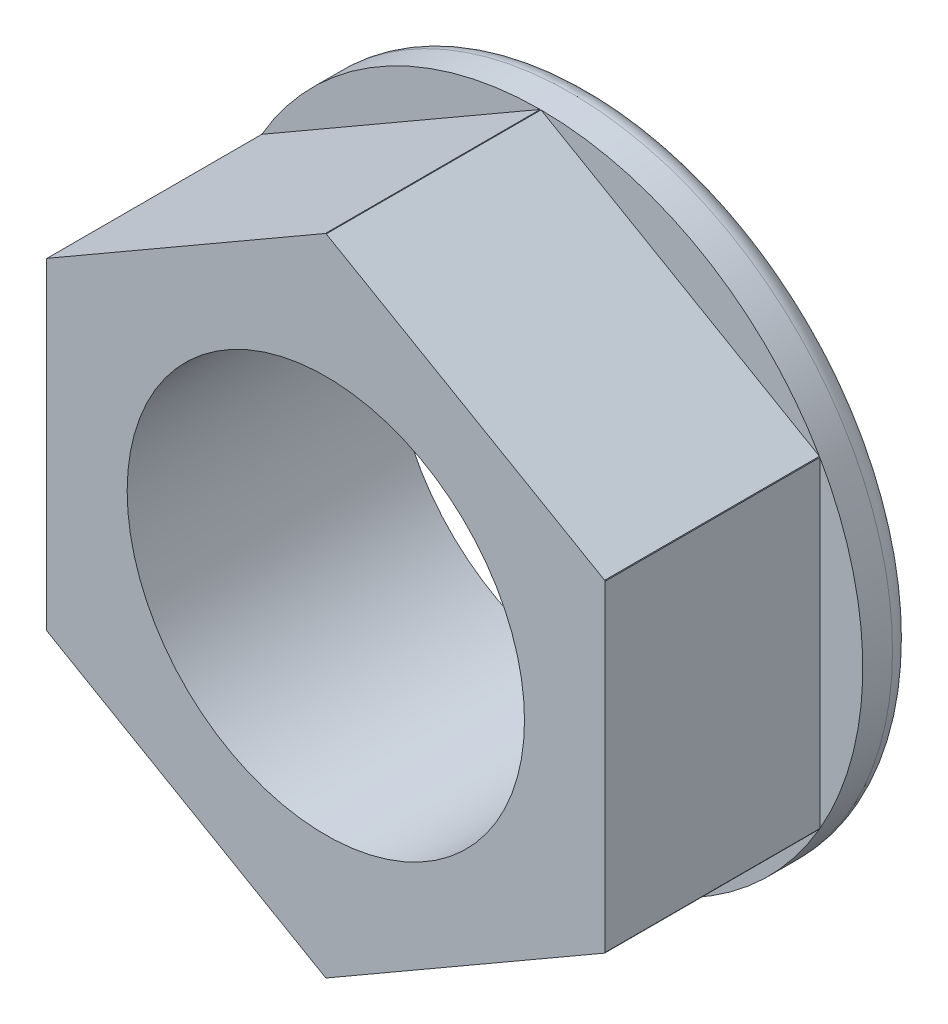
ISO-10303-21;
HEADER;
FILE_DESCRIPTION(('STEP AP214'),'2;1');
FILE_NAME('part.step','',(''),(''),'','','');
FILE_SCHEMA(('AUTOMOTIVE_DESIGN { 1 0 10303 214 1 1 1 1 }'));
ENDSEC;
DATA;
#1=APPLICATION_CONTEXT('core data for automotive mechanical design processes');
#2=APPLICATION_PROTOCOL_DEFINITION('international standard','automotive_design',2000,#1);
#3=PRODUCT_CONTEXT('',#1,'mechanical');
#4=PRODUCT('Part','Part','',(#3));
#5=PRODUCT_RELATED_PRODUCT_CATEGORY('part','',(#4));
#6=PRODUCT_DEFINITION_FORMATION('','',#4);
#7=PRODUCT_DEFINITION_CONTEXT('part definition',#1,'design');
#8=PRODUCT_DEFINITION('design','',#6,#7);
#9=PRODUCT_DEFINITION_SHAPE('','',#8);
#10=(LENGTH_UNIT() NAMED_UNIT(*) SI_UNIT(.MILLI.,.METRE.));
#11=(NAMED_UNIT(*) PLANE_ANGLE_UNIT() SI_UNIT($,.RADIAN.));
#12=(NAMED_UNIT(*) SI_UNIT($,.STERADIAN.) SOLID_ANGLE_UNIT());
#13=UNCERTAINTY_MEASURE_WITH_UNIT(LENGTH_MEASURE(1.E-05),#10,'distance_accuracy_value','');
#14=(GEOMETRIC_REPRESENTATION_CONTEXT(3) GLOBAL_UNCERTAINTY_ASSIGNED_CONTEXT((#13)) GLOBAL_UNIT_ASSIGNED_CONTEXT((#10,
#11,#12)) REPRESENTATION_CONTEXT('',''));
#15=CARTESIAN_POINT('',(0.,0.,0.));
#16=DIRECTION('',(0.,0.,1.));
#17=DIRECTION('',(1.,0.,0.));
#18=AXIS2_PLACEMENT_3D('',#15,#16,#17);
#19=CARTESIAN_POINT('',(0.,0.,9.8298));
#20=DIRECTION('',(0.,0.,1.));
#21=DIRECTION('',(1.,0.,0.));
#22=AXIS2_PLACEMENT_3D('',#19,#20,#21);
#23=PLANE('',#22);
#24=CARTESIAN_POINT('',(0.,0.,9.8298));
#25=DIRECTION('',(0.,0.,1.));
#26=DIRECTION('',(1.,0.,0.));
#27=AXIS2_PLACEMENT_3D('',#24,#25,#26);
#28=CIRCLE('',#27,7.34187);
#29=CARTESIAN_POINT('',(7.34187,0.,9.8298));
#30=VERTEX_POINT('',#29);
#31=EDGE_CURVE('E222',#30,#30,#28,.T.);
#32=ORIENTED_EDGE('',*,*,#31,.F.);
#33=EDGE_LOOP('',(#32));
#34=FACE_BOUND('',#33,.T.);
#35=CARTESIAN_POINT('',(0.,0.,9.8298));
#36=DIRECTION('',(0.,0.,1.));
#37=DIRECTION('',(1.,0.,0.));
#38=AXIS2_PLACEMENT_3D('',#35,#36,#37);
#39=CIRCLE('',#38,11.90625);
#40=CARTESIAN_POINT('',(10.31875,5.93988110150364,9.8298));
#41=VERTEX_POINT('',#40);
#42=CARTESIAN_POINT('',(10.3034629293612,5.96635908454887,9.8298));
#43=VERTEX_POINT('',#42);
#44=EDGE_CURVE('E153',#41,#43,#39,.T.);
#45=ORIENTED_EDGE('',*,*,#44,.T.);
#46=DIRECTION('',(-0.866025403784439,0.5,0.));
#47=VECTOR('',#46,1.);
#48=CARTESIAN_POINT('',(10.31875,5.95753309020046,9.8298));
#49=LINE('',#48,#47);
#50=CARTESIAN_POINT('',(0.015287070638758,11.9062401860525,9.8298));
#51=VERTEX_POINT('',#50);
#52=EDGE_CURVE('E138',#43,#51,#49,.T.);
#53=ORIENTED_EDGE('',*,*,#52,.T.);
#54=CARTESIAN_POINT('',(-0.0152870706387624,11.9062401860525,9.8298));
#55=VERTEX_POINT('',#54);
#56=EDGE_CURVE('E146',#51,#55,#39,.T.);
#57=ORIENTED_EDGE('',*,*,#56,.T.);
#58=DIRECTION('',(-0.866025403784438,-0.5,0.));
#59=VECTOR('',#58,1.);
#60=CARTESIAN_POINT('',(0.,11.9150661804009,9.8298));
#61=LINE('',#60,#59);
#62=CARTESIAN_POINT('',(-10.3034629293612,5.96635908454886,9.8298));
#63=VERTEX_POINT('',#62);
#64=EDGE_CURVE('E126',#55,#63,#61,.T.);
#65=ORIENTED_EDGE('',*,*,#64,.T.);
#66=CARTESIAN_POINT('',(-10.31875,5.93988110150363,9.8298));
#67=VERTEX_POINT('',#66);
#68=EDGE_CURVE('E154',#63,#67,#39,.T.);
#69=ORIENTED_EDGE('',*,*,#68,.T.);
#70=DIRECTION('',(0.,-1.,0.));
#71=VECTOR('',#70,1.);
#72=CARTESIAN_POINT('',(-10.31875,5.95753309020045,9.8298));
#73=LINE('',#72,#71);
#74=CARTESIAN_POINT('',(-10.31875,-5.93988110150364,9.8298));
#75=VERTEX_POINT('',#74);
#76=EDGE_CURVE('E137',#67,#75,#73,.T.);
#77=ORIENTED_EDGE('',*,*,#76,.T.);
#78=CARTESIAN_POINT('',(-10.3034629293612,-5.96635908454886,9.8298));
#79=VERTEX_POINT('',#78);
#80=EDGE_CURVE('E157',#75,#79,#39,.T.);
#81=ORIENTED_EDGE('',*,*,#80,.T.);
#82=DIRECTION('',(0.866025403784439,-0.5,0.));
#83=VECTOR('',#82,1.);
#84=CARTESIAN_POINT('',(-10.31875,-5.95753309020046,9.8298));
#85=LINE('',#84,#83);
#86=CARTESIAN_POINT('',(-0.0152870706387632,-11.9062401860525,9.8298));
#87=VERTEX_POINT('',#86);
#88=EDGE_CURVE('E233',#79,#87,#85,.T.);
#89=ORIENTED_EDGE('',*,*,#88,.T.);
#90=CARTESIAN_POINT('',(0.015287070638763,-11.9062401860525,9.8298));
#91=VERTEX_POINT('',#90);
#92=EDGE_CURVE('E260',#87,#91,#39,.T.);
#93=ORIENTED_EDGE('',*,*,#92,.T.);
#94=DIRECTION('',(0.866025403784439,0.5,0.));
#95=VECTOR('',#94,1.);
#96=CARTESIAN_POINT('',(0.,-11.9150661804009,9.8298));
#97=LINE('',#96,#95);
#98=CARTESIAN_POINT('',(10.3034629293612,-5.96635908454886,9.8298));
#99=VERTEX_POINT('',#98);
#100=EDGE_CURVE('E236',#91,#99,#97,.T.);
#101=ORIENTED_EDGE('',*,*,#100,.T.);
#102=CARTESIAN_POINT('',(10.31875,-5.93988110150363,9.8298));
#103=VERTEX_POINT('',#102);
#104=EDGE_CURVE('E156',#99,#103,#39,.T.);
#105=ORIENTED_EDGE('',*,*,#104,.T.);
#106=DIRECTION('',(0.,1.,0.));
#107=VECTOR('',#106,1.);
#108=CARTESIAN_POINT('',(10.31875,-5.95753309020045,9.8298));
#109=LINE('',#108,#107);
#110=EDGE_CURVE('E239',#103,#41,#109,.T.);
#111=ORIENTED_EDGE('',*,*,#110,.T.);
#112=EDGE_LOOP('',(#45,#53,#57,#65,#69,#77,#81,#89,#93,#101,#105,#111));
#113=FACE_BOUND('',#112,.T.);
#114=ADVANCED_FACE('F38',(#34,#113),#23,.T.);
#115=CARTESIAN_POINT('',(0.,0.,9.8298));
#116=DIRECTION('',(0.,0.,-1.));
#117=DIRECTION('',(-1.,0.,0.));
#118=AXIS2_PLACEMENT_3D('',#115,#116,#117);
#119=CYLINDRICAL_SURFACE('',#118,11.90625);
#120=CARTESIAN_POINT('',(0.,0.,0.793749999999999));
#121=DIRECTION('',(0.,0.,1.));
#122=DIRECTION('',(1.,0.,0.));
#123=AXIS2_PLACEMENT_3D('',#120,#121,#122);
#124=CIRCLE('',#123,11.90625);
#125=CARTESIAN_POINT('',(11.90625,0.,0.793749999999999));
#126=VERTEX_POINT('',#125);
#127=EDGE_CURVE('E46',#126,#126,#124,.T.);
#128=ORIENTED_EDGE('',*,*,#127,.T.);
#129=EDGE_LOOP('',(#128));
#130=FACE_BOUND('',#129,.T.);
#131=DIRECTION('',(0.,0.,-1.));
#132=VECTOR('',#131,1.);
#133=CARTESIAN_POINT('',(10.3034629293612,5.96635908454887,9.8298));
#134=LINE('',#133,#132);
#135=CARTESIAN_POINT('',(10.3034629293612,5.96635908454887,1.8923));
#136=VERTEX_POINT('',#135);
#137=EDGE_CURVE('E186',#43,#136,#134,.T.);
#138=ORIENTED_EDGE('',*,*,#137,.F.);
#139=ORIENTED_EDGE('',*,*,#44,.F.);
#140=DIRECTION('',(0.,0.,-1.));
#141=VECTOR('',#140,1.);
#142=CARTESIAN_POINT('',(10.31875,5.93988110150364,9.8298));
#143=LINE('',#142,#141);
#144=CARTESIAN_POINT('',(10.31875,5.93988110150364,1.8923));
#145=VERTEX_POINT('',#144);
#146=EDGE_CURVE('E179',#145,#41,#143,.F.);
#147=ORIENTED_EDGE('',*,*,#146,.F.);
#148=CARTESIAN_POINT('',(0.,0.,1.8923));
#149=DIRECTION('',(0.,0.,1.));
#150=DIRECTION('',(1.,0.,0.));
#151=AXIS2_PLACEMENT_3D('',#148,#149,#150);
#152=CIRCLE('',#151,11.90625);
#153=CARTESIAN_POINT('',(10.31875,-5.93988110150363,1.8923));
#154=VERTEX_POINT('',#153);
#155=EDGE_CURVE('E181',#154,#145,#152,.T.);
#156=ORIENTED_EDGE('',*,*,#155,.F.);
#157=DIRECTION('',(0.,0.,-1.));
#158=VECTOR('',#157,1.);
#159=CARTESIAN_POINT('',(10.31875,-5.93988110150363,9.8298));
#160=LINE('',#159,#158);
#161=EDGE_CURVE('E182',#103,#154,#160,.T.);
#162=ORIENTED_EDGE('',*,*,#161,.F.);
#163=ORIENTED_EDGE('',*,*,#104,.F.);
#164=DIRECTION('',(0.,0.,-1.));
#165=VECTOR('',#164,1.);
#166=CARTESIAN_POINT('',(10.3034629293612,-5.96635908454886,9.8298));
#167=LINE('',#166,#165);
#168=CARTESIAN_POINT('',(10.3034629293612,-5.96635908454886,1.8923));
#169=VERTEX_POINT('',#168);
#170=EDGE_CURVE('E174',#169,#99,#167,.F.);
#171=ORIENTED_EDGE('',*,*,#170,.F.);
#172=CARTESIAN_POINT('',(0.015287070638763,-11.9062401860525,1.8923));
#173=VERTEX_POINT('',#172);
#174=EDGE_CURVE('E176',#173,#169,#152,.T.);
#175=ORIENTED_EDGE('',*,*,#174,.F.);
#176=DIRECTION('',(0.,0.,-1.));
#177=VECTOR('',#176,1.);
#178=CARTESIAN_POINT('',(0.0152870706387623,-11.9062401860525,9.8298));
#179=LINE('',#178,#177);
#180=EDGE_CURVE('E177',#91,#173,#179,.T.);
#181=ORIENTED_EDGE('',*,*,#180,.F.);
#182=ORIENTED_EDGE('',*,*,#92,.F.);
#183=DIRECTION('',(0.,0.,-1.));
#184=VECTOR('',#183,1.);
#185=CARTESIAN_POINT('',(-0.0152870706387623,-11.9062401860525,9.8298));
#186=LINE('',#185,#184);
#187=CARTESIAN_POINT('',(-0.0152870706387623,-11.9062401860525,1.8923));
#188=VERTEX_POINT('',#187);
#189=EDGE_CURVE('E169',#188,#87,#186,.F.);
#190=ORIENTED_EDGE('',*,*,#189,.F.);
#191=CARTESIAN_POINT('',(-10.3034629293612,-5.96635908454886,1.8923));
#192=VERTEX_POINT('',#191);
#193=EDGE_CURVE('E171',#192,#188,#152,.T.);
#194=ORIENTED_EDGE('',*,*,#193,.F.);
#195=DIRECTION('',(0.,0.,-1.));
#196=VECTOR('',#195,1.);
#197=CARTESIAN_POINT('',(-10.3034629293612,-5.96635908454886,9.8298));
#198=LINE('',#197,#196);
#199=EDGE_CURVE('E172',#79,#192,#198,.T.);
#200=ORIENTED_EDGE('',*,*,#199,.F.);
#201=ORIENTED_EDGE('',*,*,#80,.F.);
#202=DIRECTION('',(0.,0.,-1.));
#203=VECTOR('',#202,1.);
#204=CARTESIAN_POINT('',(-10.31875,-5.93988110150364,9.8298));
#205=LINE('',#204,#203);
#206=CARTESIAN_POINT('',(-10.31875,-5.93988110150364,1.8923));
#207=VERTEX_POINT('',#206);
#208=EDGE_CURVE('E149',#207,#75,#205,.F.);
#209=ORIENTED_EDGE('',*,*,#208,.F.);
#210=CARTESIAN_POINT('',(-10.31875,5.93988110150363,1.8923));
#211=VERTEX_POINT('',#210);
#212=EDGE_CURVE('E164',#211,#207,#152,.T.);
#213=ORIENTED_EDGE('',*,*,#212,.F.);
#214=DIRECTION('',(0.,0.,-1.));
#215=VECTOR('',#214,1.);
#216=CARTESIAN_POINT('',(-10.31875,5.93988110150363,9.8298));
#217=LINE('',#216,#215);
#218=EDGE_CURVE('E167',#67,#211,#217,.T.);
#219=ORIENTED_EDGE('',*,*,#218,.F.);
#220=ORIENTED_EDGE('',*,*,#68,.F.);
#221=DIRECTION('',(0.,0.,-1.));
#222=VECTOR('',#221,1.);
#223=CARTESIAN_POINT('',(-10.3034629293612,5.96635908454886,9.8298));
#224=LINE('',#223,#222);
#225=CARTESIAN_POINT('',(-10.3034629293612,5.96635908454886,1.8923));
#226=VERTEX_POINT('',#225);
#227=EDGE_CURVE('E132',#226,#63,#224,.F.);
#228=ORIENTED_EDGE('',*,*,#227,.F.);
#229=CARTESIAN_POINT('',(-0.0152870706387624,11.9062401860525,1.8923));
#230=VERTEX_POINT('',#229);
#231=EDGE_CURVE('E148',#230,#226,#152,.T.);
#232=ORIENTED_EDGE('',*,*,#231,.F.);
#233=DIRECTION('',(0.,0.,-1.));
#234=VECTOR('',#233,1.);
#235=CARTESIAN_POINT('',(-0.0152870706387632,11.9062401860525,9.8298));
#236=LINE('',#235,#234);
#237=EDGE_CURVE('E129',#55,#230,#236,.T.);
#238=ORIENTED_EDGE('',*,*,#237,.F.);
#239=ORIENTED_EDGE('',*,*,#56,.F.);
#240=DIRECTION('',(0.,0.,-1.));
#241=VECTOR('',#240,1.);
#242=CARTESIAN_POINT('',(0.0152870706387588,11.9062401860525,9.8298));
#243=LINE('',#242,#241);
#244=CARTESIAN_POINT('',(0.0152870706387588,11.9062401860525,1.8923));
#245=VERTEX_POINT('',#244);
#246=EDGE_CURVE('E184',#245,#51,#243,.F.);
#247=ORIENTED_EDGE('',*,*,#246,.F.);
#248=EDGE_CURVE('E163',#136,#245,#152,.T.);
#249=ORIENTED_EDGE('',*,*,#248,.F.);
#250=EDGE_LOOP('',(#138,#139,#147,#156,#162,#163,#171,#175,#181,#182,#190,#194,#200,#201,#209,
#213,#219,#220,#228,#232,#238,#239,#247,#249));
#251=FACE_BOUND('',#250,.T.);
#252=ADVANCED_FACE('F144',(#130,#251),#119,.T.);
#253=CARTESIAN_POINT('',(0.,0.,0.));
#254=DIRECTION('',(0.,0.,1.));
#255=DIRECTION('',(1.,0.,0.));
#256=AXIS2_PLACEMENT_3D('',#253,#254,#255);
#257=PLANE('',#256);
#258=CARTESIAN_POINT('',(0.,0.,0.));
#259=DIRECTION('',(0.,0.,1.));
#260=DIRECTION('',(1.,0.,0.));
#261=AXIS2_PLACEMENT_3D('',#258,#259,#260);
#262=CIRCLE('',#261,11.1125);
#263=CARTESIAN_POINT('',(11.1125,0.,0.));
#264=VERTEX_POINT('',#263);
#265=EDGE_CURVE('E12',#264,#264,#262,.F.);
#266=ORIENTED_EDGE('',*,*,#265,.T.);
#267=EDGE_LOOP('',(#266));
#268=FACE_BOUND('',#267,.T.);
#269=CARTESIAN_POINT('',(0.,0.,0.));
#270=DIRECTION('',(0.,0.,1.));
#271=DIRECTION('',(1.,0.,0.));
#272=AXIS2_PLACEMENT_3D('',#269,#270,#271);
#273=CIRCLE('',#272,7.34187);
#274=CARTESIAN_POINT('',(7.34187,0.,0.));
#275=VERTEX_POINT('',#274);
#276=EDGE_CURVE('E160',#275,#275,#273,.T.);
#277=ORIENTED_EDGE('',*,*,#276,.T.);
#278=EDGE_LOOP('',(#277));
#279=FACE_BOUND('',#278,.T.);
#280=ADVANCED_FACE('F206',(#268,#279),#257,.F.);
#281=CARTESIAN_POINT('',(0.,0.,9.8298));
#282=DIRECTION('',(0.,0.,-1.));
#283=DIRECTION('',(-1.,0.,0.));
#284=AXIS2_PLACEMENT_3D('',#281,#282,#283);
#285=CYLINDRICAL_SURFACE('',#284,7.34187);
#286=ORIENTED_EDGE('',*,*,#31,.T.);
#287=EDGE_LOOP('',(#286));
#288=FACE_BOUND('',#287,.T.);
#289=ORIENTED_EDGE('',*,*,#276,.F.);
#290=EDGE_LOOP('',(#289));
#291=FACE_BOUND('',#290,.T.);
#292=ADVANCED_FACE('F210',(#288,#291),#285,.F.);
#293=CARTESIAN_POINT('',(0.,11.9150661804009,1.8923));
#294=DIRECTION('',(-0.5,0.866025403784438,0.));
#295=DIRECTION('',(-0.866025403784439,-0.5,0.));
#296=AXIS2_PLACEMENT_3D('',#293,#294,#295);
#297=PLANE('',#296);
#298=ORIENTED_EDGE('',*,*,#237,.T.);
#299=DIRECTION('',(-0.866025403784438,-0.5,0.));
#300=VECTOR('',#299,1.);
#301=CARTESIAN_POINT('',(0.,11.9150661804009,1.8923));
#302=LINE('',#301,#300);
#303=EDGE_CURVE('E243',#230,#226,#302,.T.);
#304=ORIENTED_EDGE('',*,*,#303,.T.);
#305=ORIENTED_EDGE('',*,*,#227,.T.);
#306=ORIENTED_EDGE('',*,*,#64,.F.);
#307=EDGE_LOOP('',(#298,#304,#305,#306));
#308=FACE_BOUND('',#307,.T.);
#309=ADVANCED_FACE('F128',(#308),#297,.T.);
#310=CARTESIAN_POINT('',(0.,0.,1.8923));
#311=DIRECTION('',(0.,0.,1.));
#312=DIRECTION('',(1.,0.,0.));
#313=AXIS2_PLACEMENT_3D('',#310,#311,#312);
#314=PLANE('',#313);
#315=ORIENTED_EDGE('',*,*,#231,.T.);
#316=ORIENTED_EDGE('',*,*,#303,.F.);
#317=EDGE_LOOP('',(#315,#316));
#318=FACE_BOUND('',#317,.T.);
#319=ADVANCED_FACE('F274',(#318),#314,.T.);
#320=CARTESIAN_POINT('',(-10.31875,5.95753309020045,1.8923));
#321=DIRECTION('',(-1.,0.,0.));
#322=DIRECTION('',(0.,-1.,0.));
#323=AXIS2_PLACEMENT_3D('',#320,#321,#322);
#324=PLANE('',#323);
#325=ORIENTED_EDGE('',*,*,#218,.T.);
#326=DIRECTION('',(0.,-1.,0.));
#327=VECTOR('',#326,1.);
#328=CARTESIAN_POINT('',(-10.31875,5.95753309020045,1.8923));
#329=LINE('',#328,#327);
#330=EDGE_CURVE('E245',#211,#207,#329,.T.);
#331=ORIENTED_EDGE('',*,*,#330,.T.);
#332=ORIENTED_EDGE('',*,*,#208,.T.);
#333=ORIENTED_EDGE('',*,*,#76,.F.);
#334=EDGE_LOOP('',(#325,#331,#332,#333));
#335=FACE_BOUND('',#334,.T.);
#336=ADVANCED_FACE('F280',(#335),#324,.T.);
#337=ORIENTED_EDGE('',*,*,#212,.T.);
#338=ORIENTED_EDGE('',*,*,#330,.F.);
#339=EDGE_LOOP('',(#337,#338));
#340=FACE_BOUND('',#339,.T.);
#341=ADVANCED_FACE('F282',(#340),#314,.T.);
#342=CARTESIAN_POINT('',(-10.31875,-5.95753309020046,1.8923));
#343=DIRECTION('',(-0.5,-0.866025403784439,0.));
#344=DIRECTION('',(0.866025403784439,-0.5,0.));
#345=AXIS2_PLACEMENT_3D('',#342,#343,#344);
#346=PLANE('',#345);
#347=ORIENTED_EDGE('',*,*,#199,.T.);
#348=DIRECTION('',(0.866025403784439,-0.5,0.));
#349=VECTOR('',#348,1.);
#350=CARTESIAN_POINT('',(-10.31875,-5.95753309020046,1.8923));
#351=LINE('',#350,#349);
#352=EDGE_CURVE('E226',#192,#188,#351,.T.);
#353=ORIENTED_EDGE('',*,*,#352,.T.);
#354=ORIENTED_EDGE('',*,*,#189,.T.);
#355=ORIENTED_EDGE('',*,*,#88,.F.);
#356=EDGE_LOOP('',(#347,#353,#354,#355));
#357=FACE_BOUND('',#356,.T.);
#358=ADVANCED_FACE('F251',(#357),#346,.T.);
#359=ORIENTED_EDGE('',*,*,#193,.T.);
#360=ORIENTED_EDGE('',*,*,#352,.F.);
#361=EDGE_LOOP('',(#359,#360));
#362=FACE_BOUND('',#361,.T.);
#363=ADVANCED_FACE('F256',(#362),#314,.T.);
#364=CARTESIAN_POINT('',(0.,-11.9150661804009,1.8923));
#365=DIRECTION('',(0.5,-0.866025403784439,0.));
#366=DIRECTION('',(0.866025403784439,0.5,0.));
#367=AXIS2_PLACEMENT_3D('',#364,#365,#366);
#368=PLANE('',#367);
#369=ORIENTED_EDGE('',*,*,#180,.T.);
#370=DIRECTION('',(0.866025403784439,0.5,0.));
#371=VECTOR('',#370,1.);
#372=CARTESIAN_POINT('',(0.,-11.9150661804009,1.8923));
#373=LINE('',#372,#371);
#374=EDGE_CURVE('E224',#173,#169,#373,.T.);
#375=ORIENTED_EDGE('',*,*,#374,.T.);
#376=ORIENTED_EDGE('',*,*,#170,.T.);
#377=ORIENTED_EDGE('',*,*,#100,.F.);
#378=EDGE_LOOP('',(#369,#375,#376,#377));
#379=FACE_BOUND('',#378,.T.);
#380=ADVANCED_FACE('F298',(#379),#368,.T.);
#381=ORIENTED_EDGE('',*,*,#174,.T.);
#382=ORIENTED_EDGE('',*,*,#374,.F.);
#383=EDGE_LOOP('',(#381,#382));
#384=FACE_BOUND('',#383,.T.);
#385=ADVANCED_FACE('F278',(#384),#314,.T.);
#386=CARTESIAN_POINT('',(10.31875,-5.95753309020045,1.8923));
#387=DIRECTION('',(1.,0.,0.));
#388=DIRECTION('',(0.,1.,0.));
#389=AXIS2_PLACEMENT_3D('',#386,#387,#388);
#390=PLANE('',#389);
#391=ORIENTED_EDGE('',*,*,#161,.T.);
#392=DIRECTION('',(0.,1.,0.));
#393=VECTOR('',#392,1.);
#394=CARTESIAN_POINT('',(10.31875,-5.95753309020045,1.8923));
#395=LINE('',#394,#393);
#396=EDGE_CURVE('E61',#154,#145,#395,.T.);
#397=ORIENTED_EDGE('',*,*,#396,.T.);
#398=ORIENTED_EDGE('',*,*,#146,.T.);
#399=ORIENTED_EDGE('',*,*,#110,.F.);
#400=EDGE_LOOP('',(#391,#397,#398,#399));
#401=FACE_BOUND('',#400,.T.);
#402=ADVANCED_FACE('F268',(#401),#390,.T.);
#403=ORIENTED_EDGE('',*,*,#155,.T.);
#404=ORIENTED_EDGE('',*,*,#396,.F.);
#405=EDGE_LOOP('',(#403,#404));
#406=FACE_BOUND('',#405,.T.);
#407=ADVANCED_FACE('F270',(#406),#314,.T.);
#408=ORIENTED_EDGE('',*,*,#248,.T.);
#409=DIRECTION('',(-0.866025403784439,0.5,0.));
#410=VECTOR('',#409,1.);
#411=CARTESIAN_POINT('',(10.31875,5.95753309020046,1.8923));
#412=LINE('',#411,#410);
#413=EDGE_CURVE('E53',#136,#245,#412,.T.);
#414=ORIENTED_EDGE('',*,*,#413,.F.);
#415=EDGE_LOOP('',(#408,#414));
#416=FACE_BOUND('',#415,.T.);
#417=ADVANCED_FACE('F197',(#416),#314,.T.);
#418=CARTESIAN_POINT('',(10.31875,5.95753309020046,1.8923));
#419=DIRECTION('',(0.5,0.866025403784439,0.));
#420=DIRECTION('',(-0.866025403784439,0.5,0.));
#421=AXIS2_PLACEMENT_3D('',#418,#419,#420);
#422=PLANE('',#421);
#423=ORIENTED_EDGE('',*,*,#137,.T.);
#424=ORIENTED_EDGE('',*,*,#413,.T.);
#425=ORIENTED_EDGE('',*,*,#246,.T.);
#426=ORIENTED_EDGE('',*,*,#52,.F.);
#427=EDGE_LOOP('',(#423,#424,#425,#426));
#428=FACE_BOUND('',#427,.T.);
#429=ADVANCED_FACE('F192',(#428),#422,.T.);
#430=CARTESIAN_POINT('',(0.,0.,0.793749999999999));
#431=DIRECTION('',(0.,0.,1.));
#432=DIRECTION('',(1.,0.,0.));
#433=AXIS2_PLACEMENT_3D('',#430,#431,#432);
#434=TOROIDAL_SURFACE('',#433,11.1125,0.79375);
#435=ORIENTED_EDGE('',*,*,#265,.F.);
#436=EDGE_LOOP('',(#435));
#437=FACE_BOUND('',#436,.T.);
#438=ORIENTED_EDGE('',*,*,#127,.F.);
#439=EDGE_LOOP('',(#438));
#440=FACE_BOUND('',#439,.T.);
#441=ADVANCED_FACE('F40',(#437,#440),#434,.T.);
#442=CLOSED_SHELL('',(#114,#252,#280,#292,#309,#319,#336,#341,#358,#363,#380,#385,#402,#407,
#417,#429,#441));
#443=MANIFOLD_SOLID_BREP('B2',#442);
#444=ADVANCED_BREP_SHAPE_REPRESENTATION('',(#18,#443),#14);
#445=SHAPE_DEFINITION_REPRESENTATION(#9,#444);
ENDSEC;
END-ISO-10303-21;
